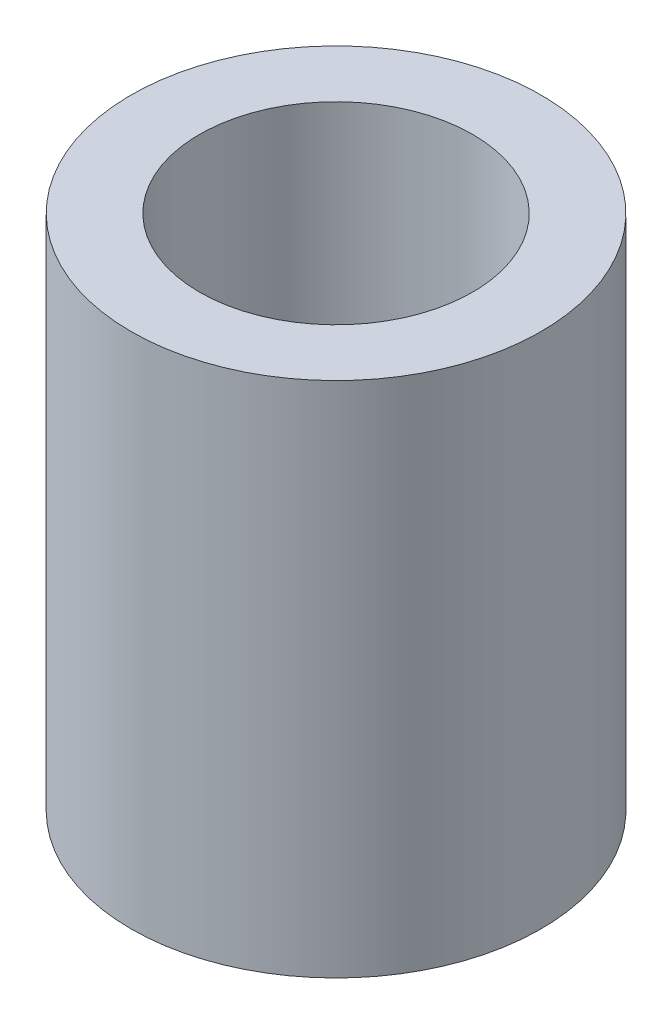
ISO-10303-21;
HEADER;
FILE_DESCRIPTION(('STEP AP214'),'2;1');
FILE_NAME('part.step','',(''),(''),'','','');
FILE_SCHEMA(('AUTOMOTIVE_DESIGN { 1 0 10303 214 1 1 1 1 }'));
ENDSEC;
DATA;
#1=APPLICATION_CONTEXT('core data for automotive mechanical design processes');
#2=APPLICATION_PROTOCOL_DEFINITION('international standard','automotive_design',2000,#1);
#3=PRODUCT_CONTEXT('',#1,'mechanical');
#4=PRODUCT('Part','Part','',(#3));
#5=PRODUCT_RELATED_PRODUCT_CATEGORY('part','',(#4));
#6=PRODUCT_DEFINITION_FORMATION('','',#4);
#7=PRODUCT_DEFINITION_CONTEXT('part definition',#1,'design');
#8=PRODUCT_DEFINITION('design','',#6,#7);
#9=PRODUCT_DEFINITION_SHAPE('','',#8);
#10=(LENGTH_UNIT() NAMED_UNIT(*) SI_UNIT(.MILLI.,.METRE.));
#11=(NAMED_UNIT(*) PLANE_ANGLE_UNIT() SI_UNIT($,.RADIAN.));
#12=(NAMED_UNIT(*) SI_UNIT($,.STERADIAN.) SOLID_ANGLE_UNIT());
#13=UNCERTAINTY_MEASURE_WITH_UNIT(LENGTH_MEASURE(1.E-05),#10,'distance_accuracy_value','');
#14=(GEOMETRIC_REPRESENTATION_CONTEXT(3) GLOBAL_UNCERTAINTY_ASSIGNED_CONTEXT((#13)) GLOBAL_UNIT_ASSIGNED_CONTEXT((#10,
#11,#12)) REPRESENTATION_CONTEXT('',''));
#15=CARTESIAN_POINT('',(0.,0.,0.));
#16=DIRECTION('',(0.,0.,1.));
#17=DIRECTION('',(1.,0.,0.));
#18=AXIS2_PLACEMENT_3D('',#15,#16,#17);
#19=CARTESIAN_POINT('',(0.,54.6,0.));
#20=DIRECTION('',(0.,1.,0.));
#21=DIRECTION('',(0.,0.,1.));
#22=AXIS2_PLACEMENT_3D('',#19,#20,#21);
#23=PLANE('',#22);
#24=CARTESIAN_POINT('',(0.,54.6,0.));
#25=DIRECTION('',(0.,1.,0.));
#26=DIRECTION('',(0.,0.,1.));
#27=AXIS2_PLACEMENT_3D('',#24,#25,#26);
#28=CIRCLE('',#27,45.);
#29=CARTESIAN_POINT('',(0.,54.6,45.));
#30=VERTEX_POINT('',#29);
#31=EDGE_CURVE('E10',#30,#30,#28,.T.);
#32=ORIENTED_EDGE('',*,*,#31,.T.);
#33=EDGE_LOOP('',(#32));
#34=FACE_BOUND('',#33,.T.);
#35=CARTESIAN_POINT('',(0.,54.6,0.));
#36=DIRECTION('',(0.,1.,0.));
#37=DIRECTION('',(0.,0.,1.));
#38=AXIS2_PLACEMENT_3D('',#35,#36,#37);
#39=CIRCLE('',#38,30.);
#40=CARTESIAN_POINT('',(0.,54.6,30.));
#41=VERTEX_POINT('',#40);
#42=EDGE_CURVE('E38',#41,#41,#39,.T.);
#43=ORIENTED_EDGE('',*,*,#42,.F.);
#44=EDGE_LOOP('',(#43));
#45=FACE_BOUND('',#44,.T.);
#46=ADVANCED_FACE('F31',(#34,#45),#23,.T.);
#47=CARTESIAN_POINT('',(0.,54.6,0.));
#48=DIRECTION('',(0.,-1.,0.));
#49=DIRECTION('',(0.,0.,-1.));
#50=AXIS2_PLACEMENT_3D('',#47,#48,#49);
#51=CYLINDRICAL_SURFACE('',#50,45.);
#52=ORIENTED_EDGE('',*,*,#31,.F.);
#53=EDGE_LOOP('',(#52));
#54=FACE_BOUND('',#53,.T.);
#55=CARTESIAN_POINT('',(0.,-59.,0.));
#56=DIRECTION('',(0.,1.,0.));
#57=DIRECTION('',(0.,0.,1.));
#58=AXIS2_PLACEMENT_3D('',#55,#56,#57);
#59=CIRCLE('',#58,45.);
#60=CARTESIAN_POINT('',(0.,-59.,45.));
#61=VERTEX_POINT('',#60);
#62=EDGE_CURVE('E42',#61,#61,#59,.T.);
#63=ORIENTED_EDGE('',*,*,#62,.T.);
#64=EDGE_LOOP('',(#63));
#65=FACE_BOUND('',#64,.T.);
#66=ADVANCED_FACE('F33',(#54,#65),#51,.T.);
#67=CARTESIAN_POINT('',(0.,54.6,0.));
#68=DIRECTION('',(0.,-1.,0.));
#69=DIRECTION('',(0.,0.,-1.));
#70=AXIS2_PLACEMENT_3D('',#67,#68,#69);
#71=CYLINDRICAL_SURFACE('',#70,30.);
#72=ORIENTED_EDGE('',*,*,#42,.T.);
#73=EDGE_LOOP('',(#72));
#74=FACE_BOUND('',#73,.T.);
#75=CARTESIAN_POINT('',(0.,-59.,0.));
#76=DIRECTION('',(0.,1.,0.));
#77=DIRECTION('',(0.,0.,1.));
#78=AXIS2_PLACEMENT_3D('',#75,#76,#77);
#79=CIRCLE('',#78,30.);
#80=CARTESIAN_POINT('',(0.,-59.,30.));
#81=VERTEX_POINT('',#80);
#82=EDGE_CURVE('E46',#81,#81,#79,.T.);
#83=ORIENTED_EDGE('',*,*,#82,.F.);
#84=EDGE_LOOP('',(#83));
#85=FACE_BOUND('',#84,.T.);
#86=ADVANCED_FACE('F55',(#74,#85),#71,.F.);
#87=CARTESIAN_POINT('',(0.,-59.,0.));
#88=DIRECTION('',(0.,1.,0.));
#89=DIRECTION('',(0.,0.,1.));
#90=AXIS2_PLACEMENT_3D('',#87,#88,#89);
#91=PLANE('',#90);
#92=ORIENTED_EDGE('',*,*,#82,.T.);
#93=EDGE_LOOP('',(#92));
#94=FACE_BOUND('',#93,.T.);
#95=ORIENTED_EDGE('',*,*,#62,.F.);
#96=EDGE_LOOP('',(#95));
#97=FACE_BOUND('',#96,.T.);
#98=ADVANCED_FACE('F52',(#94,#97),#91,.F.);
#99=CLOSED_SHELL('',(#46,#66,#86,#98));
#100=MANIFOLD_SOLID_BREP('B2',#99);
#101=ADVANCED_BREP_SHAPE_REPRESENTATION('',(#18,#100),#14);
#102=SHAPE_DEFINITION_REPRESENTATION(#9,#101);
ENDSEC;
END-ISO-10303-21;
